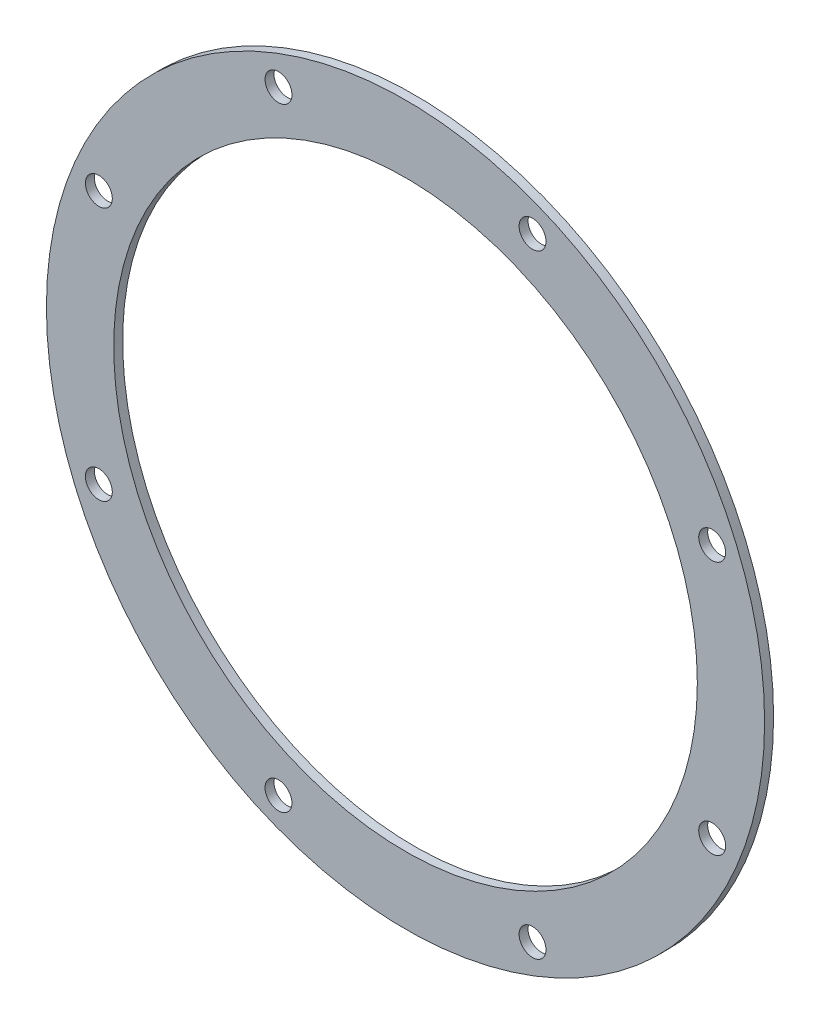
ISO-10303-21;
HEADER;
FILE_DESCRIPTION(('STEP AP214'),'2;1');
FILE_NAME('part.step','',(''),(''),'','','');
FILE_SCHEMA(('AUTOMOTIVE_DESIGN { 1 0 10303 214 1 1 1 1 }'));
ENDSEC;
DATA;
#1=APPLICATION_CONTEXT('core data for automotive mechanical design processes');
#2=APPLICATION_PROTOCOL_DEFINITION('international standard','automotive_design',2000,#1);
#3=PRODUCT_CONTEXT('',#1,'mechanical');
#4=PRODUCT('Part','Part','',(#3));
#5=PRODUCT_RELATED_PRODUCT_CATEGORY('part','',(#4));
#6=PRODUCT_DEFINITION_FORMATION('','',#4);
#7=PRODUCT_DEFINITION_CONTEXT('part definition',#1,'design');
#8=PRODUCT_DEFINITION('design','',#6,#7);
#9=PRODUCT_DEFINITION_SHAPE('','',#8);
#10=(LENGTH_UNIT() NAMED_UNIT(*) SI_UNIT(.MILLI.,.METRE.));
#11=(NAMED_UNIT(*) PLANE_ANGLE_UNIT() SI_UNIT($,.RADIAN.));
#12=(NAMED_UNIT(*) SI_UNIT($,.STERADIAN.) SOLID_ANGLE_UNIT());
#13=UNCERTAINTY_MEASURE_WITH_UNIT(LENGTH_MEASURE(1.E-05),#10,'distance_accuracy_value','');
#14=(GEOMETRIC_REPRESENTATION_CONTEXT(3) GLOBAL_UNCERTAINTY_ASSIGNED_CONTEXT((#13)) GLOBAL_UNIT_ASSIGNED_CONTEXT((#10,
#11,#12)) REPRESENTATION_CONTEXT('',''));
#15=CARTESIAN_POINT('',(0.,0.,0.));
#16=DIRECTION('',(0.,0.,1.));
#17=DIRECTION('',(1.,0.,0.));
#18=AXIS2_PLACEMENT_3D('',#15,#16,#17);
#19=CARTESIAN_POINT('',(0.,0.,0.));
#20=DIRECTION('',(0.,0.,1.));
#21=DIRECTION('',(1.,0.,0.));
#22=AXIS2_PLACEMENT_3D('',#19,#20,#21);
#23=PLANE('',#22);
#24=CARTESIAN_POINT('',(-58.7586041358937,29.0205317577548,0.));
#25=DIRECTION('',(0.,0.,1.));
#26=DIRECTION('',(1.,0.,0.));
#27=AXIS2_PLACEMENT_3D('',#24,#25,#26);
#28=CIRCLE('',#27,32.53);
#29=CARTESIAN_POINT('',(-26.2286041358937,29.0205317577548,0.));
#30=VERTEX_POINT('',#29);
#31=EDGE_CURVE('E42',#30,#30,#28,.T.);
#32=ORIENTED_EDGE('',*,*,#31,.T.);
#33=EDGE_LOOP('',(#32));
#34=FACE_BOUND('',#33,.T.);
#35=CARTESIAN_POINT('',(-72.917891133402,63.2040744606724,0.));
#36=DIRECTION('',(0.,0.,1.));
#37=DIRECTION('',(1.,0.,0.));
#38=AXIS2_PLACEMENT_3D('',#35,#36,#37);
#39=CIRCLE('',#38,1.5);
#40=CARTESIAN_POINT('',(-71.417891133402,63.2040744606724,0.));
#41=VERTEX_POINT('',#40);
#42=EDGE_CURVE('E31',#41,#41,#39,.T.);
#43=ORIENTED_EDGE('',*,*,#42,.T.);
#44=EDGE_LOOP('',(#43));
#45=FACE_BOUND('',#44,.T.);
#46=CARTESIAN_POINT('',(-44.5993171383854,63.2040744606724,0.));
#47=DIRECTION('',(0.,0.,1.));
#48=DIRECTION('',(1.,0.,0.));
#49=AXIS2_PLACEMENT_3D('',#46,#47,#48);
#50=CIRCLE('',#49,1.5);
#51=CARTESIAN_POINT('',(-43.0993171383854,63.2040744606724,0.));
#52=VERTEX_POINT('',#51);
#53=EDGE_CURVE('E89',#52,#52,#50,.T.);
#54=ORIENTED_EDGE('',*,*,#53,.T.);
#55=EDGE_LOOP('',(#54));
#56=FACE_BOUND('',#55,.T.);
#57=CARTESIAN_POINT('',(-24.575061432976,43.1798187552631,0.));
#58=DIRECTION('',(0.,0.,1.));
#59=DIRECTION('',(1.,0.,0.));
#60=AXIS2_PLACEMENT_3D('',#57,#58,#59);
#61=CIRCLE('',#60,1.5);
#62=CARTESIAN_POINT('',(-23.075061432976,43.1798187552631,0.));
#63=VERTEX_POINT('',#62);
#64=EDGE_CURVE('E81',#63,#63,#61,.T.);
#65=ORIENTED_EDGE('',*,*,#64,.T.);
#66=EDGE_LOOP('',(#65));
#67=FACE_BOUND('',#66,.T.);
#68=CARTESIAN_POINT('',(-24.575061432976,14.8612447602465,0.));
#69=DIRECTION('',(0.,0.,1.));
#70=DIRECTION('',(1.,0.,0.));
#71=AXIS2_PLACEMENT_3D('',#68,#69,#70);
#72=CIRCLE('',#71,1.5);
#73=CARTESIAN_POINT('',(-23.075061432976,14.8612447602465,0.));
#74=VERTEX_POINT('',#73);
#75=EDGE_CURVE('E73',#74,#74,#72,.T.);
#76=ORIENTED_EDGE('',*,*,#75,.T.);
#77=EDGE_LOOP('',(#76));
#78=FACE_BOUND('',#77,.T.);
#79=CARTESIAN_POINT('',(-44.5993171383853,-5.16301094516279,0.));
#80=DIRECTION('',(0.,0.,1.));
#81=DIRECTION('',(1.,0.,0.));
#82=AXIS2_PLACEMENT_3D('',#79,#80,#81);
#83=CIRCLE('',#82,1.5);
#84=CARTESIAN_POINT('',(-43.0993171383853,-5.16301094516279,0.));
#85=VERTEX_POINT('',#84);
#86=EDGE_CURVE('E65',#85,#85,#83,.T.);
#87=ORIENTED_EDGE('',*,*,#86,.T.);
#88=EDGE_LOOP('',(#87));
#89=FACE_BOUND('',#88,.T.);
#90=CARTESIAN_POINT('',(-72.9178911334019,-5.16301094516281,0.));
#91=DIRECTION('',(0.,0.,1.));
#92=DIRECTION('',(1.,0.,0.));
#93=AXIS2_PLACEMENT_3D('',#90,#91,#92);
#94=CIRCLE('',#93,1.5);
#95=CARTESIAN_POINT('',(-71.4178911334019,-5.16301094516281,0.));
#96=VERTEX_POINT('',#95);
#97=EDGE_CURVE('E57',#96,#96,#94,.T.);
#98=ORIENTED_EDGE('',*,*,#97,.T.);
#99=EDGE_LOOP('',(#98));
#100=FACE_BOUND('',#99,.T.);
#101=CARTESIAN_POINT('',(-92.9421468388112,14.8612447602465,0.));
#102=DIRECTION('',(0.,0.,1.));
#103=DIRECTION('',(1.,0.,0.));
#104=AXIS2_PLACEMENT_3D('',#101,#102,#103);
#105=CIRCLE('',#104,1.5);
#106=CARTESIAN_POINT('',(-91.4421468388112,14.8612447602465,0.));
#107=VERTEX_POINT('',#106);
#108=EDGE_CURVE('E44',#107,#107,#105,.T.);
#109=ORIENTED_EDGE('',*,*,#108,.T.);
#110=EDGE_LOOP('',(#109));
#111=FACE_BOUND('',#110,.T.);
#112=CARTESIAN_POINT('',(-92.9421468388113,43.1798187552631,0.));
#113=DIRECTION('',(0.,0.,1.));
#114=DIRECTION('',(1.,0.,0.));
#115=AXIS2_PLACEMENT_3D('',#112,#113,#114);
#116=CIRCLE('',#115,1.5);
#117=CARTESIAN_POINT('',(-91.4421468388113,43.1798187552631,0.));
#118=VERTEX_POINT('',#117);
#119=EDGE_CURVE('E53',#118,#118,#116,.T.);
#120=ORIENTED_EDGE('',*,*,#119,.T.);
#121=EDGE_LOOP('',(#120));
#122=FACE_BOUND('',#121,.T.);
#123=CARTESIAN_POINT('',(-58.7586041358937,29.0205317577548,0.));
#124=DIRECTION('',(0.,0.,1.));
#125=DIRECTION('',(1.,0.,0.));
#126=AXIS2_PLACEMENT_3D('',#123,#124,#125);
#127=CIRCLE('',#126,40.03);
#128=CARTESIAN_POINT('',(-18.7286041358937,29.0205317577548,0.));
#129=VERTEX_POINT('',#128);
#130=EDGE_CURVE('E10',#129,#129,#127,.T.);
#131=ORIENTED_EDGE('',*,*,#130,.F.);
#132=EDGE_LOOP('',(#131));
#133=FACE_BOUND('',#132,.T.);
#134=ADVANCED_FACE('F15',(#34,#45,#56,#67,#78,#89,#100,#111,#122,#133),#23,.F.);
#135=CARTESIAN_POINT('',(0.,0.,1.));
#136=DIRECTION('',(0.,0.,1.));
#137=DIRECTION('',(1.,0.,0.));
#138=AXIS2_PLACEMENT_3D('',#135,#136,#137);
#139=PLANE('',#138);
#140=CARTESIAN_POINT('',(-58.7586041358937,29.0205317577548,1.));
#141=DIRECTION('',(0.,0.,1.));
#142=DIRECTION('',(1.,0.,0.));
#143=AXIS2_PLACEMENT_3D('',#140,#141,#142);
#144=CIRCLE('',#143,32.53);
#145=CARTESIAN_POINT('',(-26.2286041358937,29.0205317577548,1.));
#146=VERTEX_POINT('',#145);
#147=EDGE_CURVE('E130',#146,#146,#144,.T.);
#148=ORIENTED_EDGE('',*,*,#147,.F.);
#149=EDGE_LOOP('',(#148));
#150=FACE_BOUND('',#149,.T.);
#151=CARTESIAN_POINT('',(-72.917891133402,63.2040744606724,1.));
#152=DIRECTION('',(0.,0.,1.));
#153=DIRECTION('',(1.,0.,0.));
#154=AXIS2_PLACEMENT_3D('',#151,#152,#153);
#155=CIRCLE('',#154,1.5);
#156=CARTESIAN_POINT('',(-71.417891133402,63.2040744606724,1.));
#157=VERTEX_POINT('',#156);
#158=EDGE_CURVE('E39',#157,#157,#155,.T.);
#159=ORIENTED_EDGE('',*,*,#158,.F.);
#160=EDGE_LOOP('',(#159));
#161=FACE_BOUND('',#160,.T.);
#162=CARTESIAN_POINT('',(-44.5993171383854,63.2040744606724,1.));
#163=DIRECTION('',(0.,0.,1.));
#164=DIRECTION('',(1.,0.,0.));
#165=AXIS2_PLACEMENT_3D('',#162,#163,#164);
#166=CIRCLE('',#165,1.5);
#167=CARTESIAN_POINT('',(-43.0993171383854,63.2040744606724,1.));
#168=VERTEX_POINT('',#167);
#169=EDGE_CURVE('E85',#168,#168,#166,.T.);
#170=ORIENTED_EDGE('',*,*,#169,.F.);
#171=EDGE_LOOP('',(#170));
#172=FACE_BOUND('',#171,.T.);
#173=CARTESIAN_POINT('',(-24.575061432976,43.1798187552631,1.));
#174=DIRECTION('',(0.,0.,1.));
#175=DIRECTION('',(1.,0.,0.));
#176=AXIS2_PLACEMENT_3D('',#173,#174,#175);
#177=CIRCLE('',#176,1.5);
#178=CARTESIAN_POINT('',(-23.075061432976,43.1798187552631,1.));
#179=VERTEX_POINT('',#178);
#180=EDGE_CURVE('E77',#179,#179,#177,.T.);
#181=ORIENTED_EDGE('',*,*,#180,.F.);
#182=EDGE_LOOP('',(#181));
#183=FACE_BOUND('',#182,.T.);
#184=CARTESIAN_POINT('',(-24.575061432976,14.8612447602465,1.));
#185=DIRECTION('',(0.,0.,1.));
#186=DIRECTION('',(1.,0.,0.));
#187=AXIS2_PLACEMENT_3D('',#184,#185,#186);
#188=CIRCLE('',#187,1.5);
#189=CARTESIAN_POINT('',(-23.075061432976,14.8612447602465,1.));
#190=VERTEX_POINT('',#189);
#191=EDGE_CURVE('E69',#190,#190,#188,.T.);
#192=ORIENTED_EDGE('',*,*,#191,.F.);
#193=EDGE_LOOP('',(#192));
#194=FACE_BOUND('',#193,.T.);
#195=CARTESIAN_POINT('',(-44.5993171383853,-5.16301094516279,1.));
#196=DIRECTION('',(0.,0.,1.));
#197=DIRECTION('',(1.,0.,0.));
#198=AXIS2_PLACEMENT_3D('',#195,#196,#197);
#199=CIRCLE('',#198,1.5);
#200=CARTESIAN_POINT('',(-43.0993171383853,-5.16301094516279,1.));
#201=VERTEX_POINT('',#200);
#202=EDGE_CURVE('E61',#201,#201,#199,.T.);
#203=ORIENTED_EDGE('',*,*,#202,.F.);
#204=EDGE_LOOP('',(#203));
#205=FACE_BOUND('',#204,.T.);
#206=CARTESIAN_POINT('',(-72.9178911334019,-5.16301094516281,1.));
#207=DIRECTION('',(0.,0.,1.));
#208=DIRECTION('',(1.,0.,0.));
#209=AXIS2_PLACEMENT_3D('',#206,#207,#208);
#210=CIRCLE('',#209,1.5);
#211=CARTESIAN_POINT('',(-71.4178911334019,-5.16301094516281,1.));
#212=VERTEX_POINT('',#211);
#213=EDGE_CURVE('E48',#212,#212,#210,.T.);
#214=ORIENTED_EDGE('',*,*,#213,.F.);
#215=EDGE_LOOP('',(#214));
#216=FACE_BOUND('',#215,.T.);
#217=CARTESIAN_POINT('',(-92.9421468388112,14.8612447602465,1.));
#218=DIRECTION('',(0.,0.,1.));
#219=DIRECTION('',(1.,0.,0.));
#220=AXIS2_PLACEMENT_3D('',#217,#218,#219);
#221=CIRCLE('',#220,1.5);
#222=CARTESIAN_POINT('',(-91.4421468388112,14.8612447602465,1.));
#223=VERTEX_POINT('',#222);
#224=EDGE_CURVE('E49',#223,#223,#221,.T.);
#225=ORIENTED_EDGE('',*,*,#224,.F.);
#226=EDGE_LOOP('',(#225));
#227=FACE_BOUND('',#226,.T.);
#228=CARTESIAN_POINT('',(-92.9421468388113,43.1798187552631,1.));
#229=DIRECTION('',(0.,0.,1.));
#230=DIRECTION('',(1.,0.,0.));
#231=AXIS2_PLACEMENT_3D('',#228,#229,#230);
#232=CIRCLE('',#231,1.5);
#233=CARTESIAN_POINT('',(-91.4421468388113,43.1798187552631,1.));
#234=VERTEX_POINT('',#233);
#235=EDGE_CURVE('E120',#234,#234,#232,.T.);
#236=ORIENTED_EDGE('',*,*,#235,.F.);
#237=EDGE_LOOP('',(#236));
#238=FACE_BOUND('',#237,.T.);
#239=CARTESIAN_POINT('',(-58.7586041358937,29.0205317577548,1.));
#240=DIRECTION('',(0.,0.,1.));
#241=DIRECTION('',(1.,0.,0.));
#242=AXIS2_PLACEMENT_3D('',#239,#240,#241);
#243=CIRCLE('',#242,40.03);
#244=CARTESIAN_POINT('',(-18.7286041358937,29.0205317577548,1.));
#245=VERTEX_POINT('',#244);
#246=EDGE_CURVE('E22',#245,#245,#243,.T.);
#247=ORIENTED_EDGE('',*,*,#246,.T.);
#248=EDGE_LOOP('',(#247));
#249=FACE_BOUND('',#248,.T.);
#250=ADVANCED_FACE('F101',(#150,#161,#172,#183,#194,#205,#216,#227,#238,#249),#139,.T.);
#251=CARTESIAN_POINT('',(-58.7586041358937,29.0205317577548,1.));
#252=DIRECTION('',(0.,0.,-1.));
#253=DIRECTION('',(-1.,0.,0.));
#254=AXIS2_PLACEMENT_3D('',#251,#252,#253);
#255=CYLINDRICAL_SURFACE('',#254,40.03);
#256=ORIENTED_EDGE('',*,*,#130,.T.);
#257=EDGE_LOOP('',(#256));
#258=FACE_BOUND('',#257,.T.);
#259=ORIENTED_EDGE('',*,*,#246,.F.);
#260=EDGE_LOOP('',(#259));
#261=FACE_BOUND('',#260,.T.);
#262=ADVANCED_FACE('F104',(#258,#261),#255,.T.);
#263=CARTESIAN_POINT('',(-72.917891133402,63.2040744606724,1.));
#264=DIRECTION('',(0.,0.,-1.));
#265=DIRECTION('',(-1.,0.,0.));
#266=AXIS2_PLACEMENT_3D('',#263,#264,#265);
#267=CYLINDRICAL_SURFACE('',#266,1.5);
#268=ORIENTED_EDGE('',*,*,#42,.F.);
#269=EDGE_LOOP('',(#268));
#270=FACE_BOUND('',#269,.T.);
#271=ORIENTED_EDGE('',*,*,#158,.T.);
#272=EDGE_LOOP('',(#271));
#273=FACE_BOUND('',#272,.T.);
#274=ADVANCED_FACE('F99',(#270,#273),#267,.F.);
#275=CARTESIAN_POINT('',(-44.5993171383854,63.2040744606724,1.));
#276=DIRECTION('',(0.,0.,-1.));
#277=DIRECTION('',(-1.,0.,0.));
#278=AXIS2_PLACEMENT_3D('',#275,#276,#277);
#279=CYLINDRICAL_SURFACE('',#278,1.5);
#280=ORIENTED_EDGE('',*,*,#53,.F.);
#281=EDGE_LOOP('',(#280));
#282=FACE_BOUND('',#281,.T.);
#283=ORIENTED_EDGE('',*,*,#169,.T.);
#284=EDGE_LOOP('',(#283));
#285=FACE_BOUND('',#284,.T.);
#286=ADVANCED_FACE('F184',(#282,#285),#279,.F.);
#287=CARTESIAN_POINT('',(-24.575061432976,43.1798187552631,1.));
#288=DIRECTION('',(0.,0.,-1.));
#289=DIRECTION('',(-1.,0.,0.));
#290=AXIS2_PLACEMENT_3D('',#287,#288,#289);
#291=CYLINDRICAL_SURFACE('',#290,1.5);
#292=ORIENTED_EDGE('',*,*,#64,.F.);
#293=EDGE_LOOP('',(#292));
#294=FACE_BOUND('',#293,.T.);
#295=ORIENTED_EDGE('',*,*,#180,.T.);
#296=EDGE_LOOP('',(#295));
#297=FACE_BOUND('',#296,.T.);
#298=ADVANCED_FACE('F187',(#294,#297),#291,.F.);
#299=CARTESIAN_POINT('',(-24.575061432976,14.8612447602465,1.));
#300=DIRECTION('',(0.,0.,-1.));
#301=DIRECTION('',(-1.,0.,0.));
#302=AXIS2_PLACEMENT_3D('',#299,#300,#301);
#303=CYLINDRICAL_SURFACE('',#302,1.5);
#304=ORIENTED_EDGE('',*,*,#75,.F.);
#305=EDGE_LOOP('',(#304));
#306=FACE_BOUND('',#305,.T.);
#307=ORIENTED_EDGE('',*,*,#191,.T.);
#308=EDGE_LOOP('',(#307));
#309=FACE_BOUND('',#308,.T.);
#310=ADVANCED_FACE('F191',(#306,#309),#303,.F.);
#311=CARTESIAN_POINT('',(-44.5993171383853,-5.16301094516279,1.));
#312=DIRECTION('',(0.,0.,-1.));
#313=DIRECTION('',(-1.,0.,0.));
#314=AXIS2_PLACEMENT_3D('',#311,#312,#313);
#315=CYLINDRICAL_SURFACE('',#314,1.5);
#316=ORIENTED_EDGE('',*,*,#86,.F.);
#317=EDGE_LOOP('',(#316));
#318=FACE_BOUND('',#317,.T.);
#319=ORIENTED_EDGE('',*,*,#202,.T.);
#320=EDGE_LOOP('',(#319));
#321=FACE_BOUND('',#320,.T.);
#322=ADVANCED_FACE('F180',(#318,#321),#315,.F.);
#323=CARTESIAN_POINT('',(-72.9178911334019,-5.16301094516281,1.));
#324=DIRECTION('',(0.,0.,-1.));
#325=DIRECTION('',(-1.,0.,0.));
#326=AXIS2_PLACEMENT_3D('',#323,#324,#325);
#327=CYLINDRICAL_SURFACE('',#326,1.5);
#328=ORIENTED_EDGE('',*,*,#97,.F.);
#329=EDGE_LOOP('',(#328));
#330=FACE_BOUND('',#329,.T.);
#331=ORIENTED_EDGE('',*,*,#213,.T.);
#332=EDGE_LOOP('',(#331));
#333=FACE_BOUND('',#332,.T.);
#334=ADVANCED_FACE('F175',(#330,#333),#327,.F.);
#335=CARTESIAN_POINT('',(-92.9421468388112,14.8612447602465,1.));
#336=DIRECTION('',(0.,0.,-1.));
#337=DIRECTION('',(-1.,0.,0.));
#338=AXIS2_PLACEMENT_3D('',#335,#336,#337);
#339=CYLINDRICAL_SURFACE('',#338,1.5);
#340=ORIENTED_EDGE('',*,*,#108,.F.);
#341=EDGE_LOOP('',(#340));
#342=FACE_BOUND('',#341,.T.);
#343=ORIENTED_EDGE('',*,*,#224,.T.);
#344=EDGE_LOOP('',(#343));
#345=FACE_BOUND('',#344,.T.);
#346=ADVANCED_FACE('F147',(#342,#345),#339,.F.);
#347=CARTESIAN_POINT('',(-92.9421468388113,43.1798187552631,1.));
#348=DIRECTION('',(0.,0.,-1.));
#349=DIRECTION('',(-1.,0.,0.));
#350=AXIS2_PLACEMENT_3D('',#347,#348,#349);
#351=CYLINDRICAL_SURFACE('',#350,1.5);
#352=ORIENTED_EDGE('',*,*,#119,.F.);
#353=EDGE_LOOP('',(#352));
#354=FACE_BOUND('',#353,.T.);
#355=ORIENTED_EDGE('',*,*,#235,.T.);
#356=EDGE_LOOP('',(#355));
#357=FACE_BOUND('',#356,.T.);
#358=ADVANCED_FACE('F140',(#354,#357),#351,.F.);
#359=CARTESIAN_POINT('',(-58.7586041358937,29.0205317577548,1.));
#360=DIRECTION('',(0.,0.,-1.));
#361=DIRECTION('',(-1.,0.,0.));
#362=AXIS2_PLACEMENT_3D('',#359,#360,#361);
#363=CYLINDRICAL_SURFACE('',#362,32.53);
#364=ORIENTED_EDGE('',*,*,#31,.F.);
#365=EDGE_LOOP('',(#364));
#366=FACE_BOUND('',#365,.T.);
#367=ORIENTED_EDGE('',*,*,#147,.T.);
#368=EDGE_LOOP('',(#367));
#369=FACE_BOUND('',#368,.T.);
#370=ADVANCED_FACE('F138',(#366,#369),#363,.F.);
#371=CLOSED_SHELL('',(#134,#250,#262,#274,#286,#298,#310,#322,#334,#346,#358,#370));
#372=MANIFOLD_SOLID_BREP('B1',#371);
#373=ADVANCED_BREP_SHAPE_REPRESENTATION('',(#18,#372),#14);
#374=SHAPE_DEFINITION_REPRESENTATION(#9,#373);
ENDSEC;
END-ISO-10303-21;
